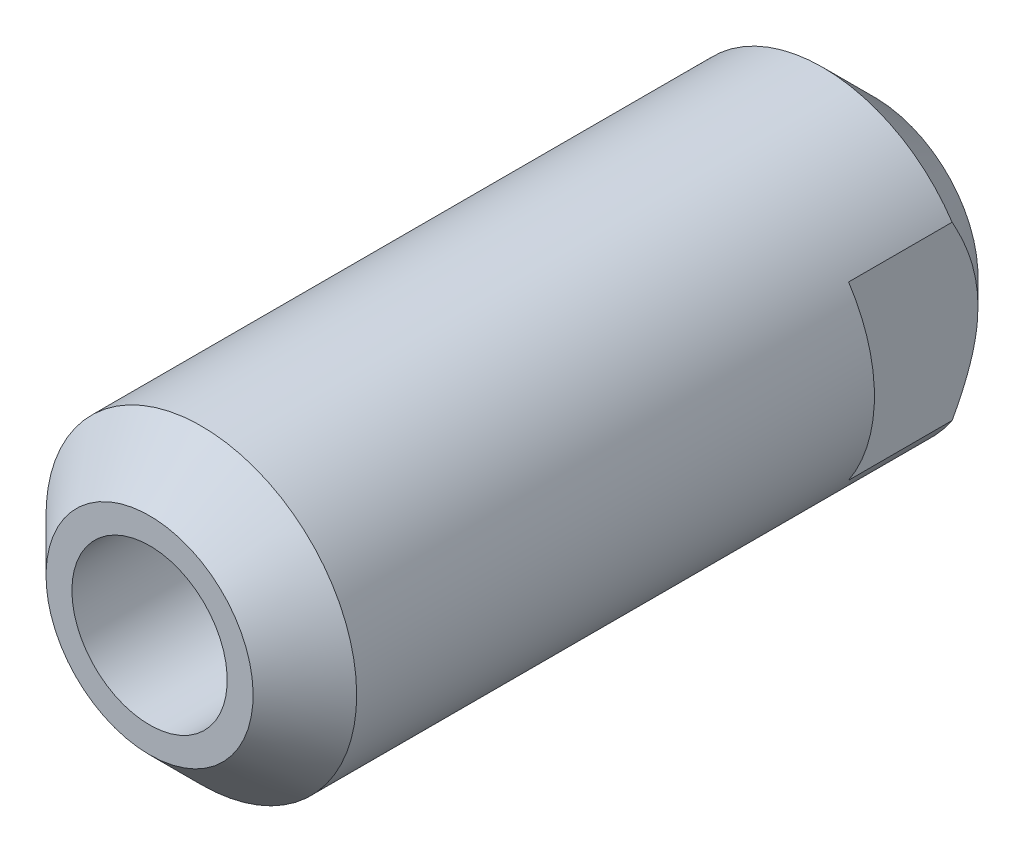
ISO-10303-21;
HEADER;
FILE_DESCRIPTION(('STEP AP214'),'2;1');
FILE_NAME('part.step','',(''),(''),'','','');
FILE_SCHEMA(('AUTOMOTIVE_DESIGN { 1 0 10303 214 1 1 1 1 }'));
ENDSEC;
DATA;
#1=APPLICATION_CONTEXT('core data for automotive mechanical design processes');
#2=APPLICATION_PROTOCOL_DEFINITION('international standard','automotive_design',2000,#1);
#3=PRODUCT_CONTEXT('',#1,'mechanical');
#4=PRODUCT('Part','Part','',(#3));
#5=PRODUCT_RELATED_PRODUCT_CATEGORY('part','',(#4));
#6=PRODUCT_DEFINITION_FORMATION('','',#4);
#7=PRODUCT_DEFINITION_CONTEXT('part definition',#1,'design');
#8=PRODUCT_DEFINITION('design','',#6,#7);
#9=PRODUCT_DEFINITION_SHAPE('','',#8);
#10=(LENGTH_UNIT() NAMED_UNIT(*) SI_UNIT(.MILLI.,.METRE.));
#11=(NAMED_UNIT(*) PLANE_ANGLE_UNIT() SI_UNIT($,.RADIAN.));
#12=(NAMED_UNIT(*) SI_UNIT($,.STERADIAN.) SOLID_ANGLE_UNIT());
#13=UNCERTAINTY_MEASURE_WITH_UNIT(LENGTH_MEASURE(1.E-05),#10,'distance_accuracy_value','');
#14=(GEOMETRIC_REPRESENTATION_CONTEXT(3) GLOBAL_UNCERTAINTY_ASSIGNED_CONTEXT((#13)) GLOBAL_UNIT_ASSIGNED_CONTEXT((#10,
#11,#12)) REPRESENTATION_CONTEXT('',''));
#15=CARTESIAN_POINT('',(0.,0.,0.));
#16=DIRECTION('',(0.,0.,1.));
#17=DIRECTION('',(1.,0.,0.));
#18=AXIS2_PLACEMENT_3D('',#15,#16,#17);
#19=CARTESIAN_POINT('',(-5.00000000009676,-3.35642428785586,6.));
#20=DIRECTION('',(0.,0.,1.));
#21=DIRECTION('',(2.88275454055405E-11,1.,0.));
#22=AXIS2_PLACEMENT_3D('',#19,#20,#21);
#23=PLANE('',#22);
#24=DIRECTION('',(-2.88275454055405E-11,-1.,0.));
#25=VECTOR('',#24,1.);
#26=CARTESIAN_POINT('',(-5.,1.44137727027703E-10,6.));
#27=LINE('',#26,#25);
#28=CARTESIAN_POINT('',(-4.99999999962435,3.31662479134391,6.000000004));
#29=VERTEX_POINT('',#28);
#30=CARTESIAN_POINT('',(-5.0000000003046,-3.31662478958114,6.000000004));
#31=VERTEX_POINT('',#30);
#32=EDGE_CURVE('E54',#29,#31,#27,.T.);
#33=ORIENTED_EDGE('',*,*,#32,.T.);
#34=CARTESIAN_POINT('',(0.,0.,6.000000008));
#35=DIRECTION('',(0.,0.,1.));
#36=DIRECTION('',(-1.,2.88275454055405E-11,0.));
#37=AXIS2_PLACEMENT_3D('',#34,#35,#36);
#38=CIRCLE('',#37,6.);
#39=EDGE_CURVE('E18',#29,#31,#38,.T.);
#40=ORIENTED_EDGE('',*,*,#39,.F.);
#41=EDGE_LOOP('',(#33,#40));
#42=FACE_BOUND('',#41,.T.);
#43=ADVANCED_FACE('F14',(#42),#23,.F.);
#44=CARTESIAN_POINT('',(6.04983453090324,-3.3564242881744,6.));
#45=DIRECTION('',(0.,0.,1.));
#46=DIRECTION('',(2.88275454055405E-11,1.,0.));
#47=AXIS2_PLACEMENT_3D('',#44,#45,#46);
#48=PLANE('',#47);
#49=DIRECTION('',(2.88275454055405E-11,1.,0.));
#50=VECTOR('',#49,1.);
#51=CARTESIAN_POINT('',(5.,-1.44137727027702E-10,6.));
#52=LINE('',#51,#50);
#53=CARTESIAN_POINT('',(4.99999999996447,-3.31662479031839,6.000000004));
#54=VERTEX_POINT('',#53);
#55=CARTESIAN_POINT('',(4.99999999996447,3.31662479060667,6.000000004));
#56=VERTEX_POINT('',#55);
#57=EDGE_CURVE('E71',#54,#56,#52,.T.);
#58=ORIENTED_EDGE('',*,*,#57,.T.);
#59=CARTESIAN_POINT('',(0.,0.,6.000000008));
#60=DIRECTION('',(0.,0.,1.));
#61=DIRECTION('',(-1.,2.88275454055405E-11,0.));
#62=AXIS2_PLACEMENT_3D('',#59,#60,#61);
#63=CIRCLE('',#62,6.);
#64=EDGE_CURVE('E147',#54,#56,#63,.T.);
#65=ORIENTED_EDGE('',*,*,#64,.F.);
#66=EDGE_LOOP('',(#58,#65));
#67=FACE_BOUND('',#66,.T.);
#68=ADVANCED_FACE('F138',(#67),#48,.F.);
#69=CARTESIAN_POINT('',(-4.99999999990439,3.31662479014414,0.942674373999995));
#70=DIRECTION('',(1.,-2.88275454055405E-11,0.));
#71=DIRECTION('',(0.,0.,1.));
#72=AXIS2_PLACEMENT_3D('',#69,#70,#71);
#73=PLANE('',#72);
#74=CARTESIAN_POINT('',(-5.00000000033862,-3.31662478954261,1.99999999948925));
#75=CARTESIAN_POINT('',(-5.00000000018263,-3.22769814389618,1.95084947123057));
#76=CARTESIAN_POINT('',(-5.00000000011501,-3.1381959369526,1.90274222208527));
#77=CARTESIAN_POINT('',(-5.00000000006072,-2.95792294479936,1.80890434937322));
#78=CARTESIAN_POINT('',(-5.00000000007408,-2.86715180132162,1.76317441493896));
#79=CARTESIAN_POINT('',(-5.00000000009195,-2.59213467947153,1.6296872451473));
#80=CARTESIAN_POINT('',(-5.00000000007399,-2.40586588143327,1.54601451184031));
#81=CARTESIAN_POINT('',(-5.00000000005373,-2.02581803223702,1.39198439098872));
#82=CARTESIAN_POINT('',(-5.00000000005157,-1.83198534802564,1.3217576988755));
#83=CARTESIAN_POINT('',(-5.00000000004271,-1.43883347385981,1.19956614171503));
#84=CARTESIAN_POINT('',(-5.00000000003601,-1.23952350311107,1.14757240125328));
#85=CARTESIAN_POINT('',(-5.00000000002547,-0.890804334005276,1.07668679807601));
#86=CARTESIAN_POINT('',(-5.00000000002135,-0.742441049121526,1.05264869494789));
#87=CARTESIAN_POINT('',(-5.00000000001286,-0.444151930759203,1.01750537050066));
#88=CARTESIAN_POINT('',(-5.0000000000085,-0.294226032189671,1.00640069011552));
#89=CARTESIAN_POINT('',(-4.99999999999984,0.00508217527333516,0.997778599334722));
#90=CARTESIAN_POINT('',(-4.99999999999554,0.154462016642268,1.00017661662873));
#91=CARTESIAN_POINT('',(-4.99999999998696,0.452409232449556,1.01822109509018));
#92=CARTESIAN_POINT('',(-4.99999999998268,0.600976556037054,1.03386837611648));
#93=CARTESIAN_POINT('',(-4.9999999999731,0.933262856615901,1.08307594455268));
#94=CARTESIAN_POINT('',(-4.99999999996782,1.11646272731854,1.12014207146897));
#95=CARTESIAN_POINT('',(-4.99999999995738,1.47863691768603,1.21109899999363));
#96=CARTESIAN_POINT('',(-4.99999999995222,1.65760895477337,1.26499867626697));
#97=CARTESIAN_POINT('',(-4.99999999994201,2.01163790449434,1.38692000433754));
#98=CARTESIAN_POINT('',(-4.99999999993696,2.18666980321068,1.45501320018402));
#99=CARTESIAN_POINT('',(-4.99999999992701,2.53188011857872,1.60232433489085));
#100=CARTESIAN_POINT('',(-4.99999999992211,2.70205985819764,1.68153920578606));
#101=CARTESIAN_POINT('',(-4.99999999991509,2.94549138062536,1.80272733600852));
#102=CARTESIAN_POINT('',(-4.99999999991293,3.02052062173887,1.84119139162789));
#103=CARTESIAN_POINT('',(-4.99999999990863,3.16936965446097,1.91953739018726));
#104=CARTESIAN_POINT('',(-4.99999999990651,3.24319355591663,1.95941151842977));
#105=CARTESIAN_POINT('',(-4.99999999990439,3.31662479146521,2.00000000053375));
#106=B_SPLINE_CURVE_WITH_KNOTS('',3,(#74,#75,#76,#77,#78,#79,#80,#81,#82,#83,#84,#85,#86,#87,
#88,#89,#90,#91,#92,#93,#94,#95,#96,#97,#98,#99,#100,#101,#102,#103,#104,#105),.UNSPECIFIED.,
.F.,.F.,(4,2,2,2,2,2,2,2,2,2,2,2,2,2,2,4),(0.,0.30480377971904,0.609695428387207,
1.22181743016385,1.83961676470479,2.45643322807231,2.9068223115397,3.3572302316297,
3.80482023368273,4.25243793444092,4.81220618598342,5.37227004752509,5.93522837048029,
6.49803170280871,6.75095972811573,7.00265636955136),.UNSPECIFIED.);
#107=CARTESIAN_POINT('',(-5.00000000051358,-3.31662478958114,2.));
#108=VERTEX_POINT('',#107);
#109=CARTESIAN_POINT('',(-4.9999999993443,3.31662479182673,2.00000000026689));
#110=VERTEX_POINT('',#109);
#111=EDGE_CURVE('E70',#108,#110,#106,.T.);
#112=ORIENTED_EDGE('',*,*,#111,.F.);
#113=DIRECTION('',(0.,0.,-1.));
#114=VECTOR('',#113,1.);
#115=CARTESIAN_POINT('',(-5.00000000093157,-3.31662478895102,14.));
#116=LINE('',#115,#114);
#117=EDGE_CURVE('E63',#31,#108,#116,.T.);
#118=ORIENTED_EDGE('',*,*,#117,.F.);
#119=ORIENTED_EDGE('',*,*,#32,.F.);
#120=DIRECTION('',(0.,0.,1.));
#121=VECTOR('',#120,1.);
#122=CARTESIAN_POINT('',(-4.99999999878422,3.31662479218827,14.));
#123=LINE('',#122,#121);
#124=EDGE_CURVE('E65',#110,#29,#123,.T.);
#125=ORIENTED_EDGE('',*,*,#124,.F.);
#126=EDGE_LOOP('',(#112,#118,#119,#125));
#127=FACE_BOUND('',#126,.T.);
#128=ADVANCED_FACE('F68',(#127),#73,.F.);
#129=CARTESIAN_POINT('',(5.00000000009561,3.31662478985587,6.));
#130=DIRECTION('',(-1.,2.88275454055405E-11,0.));
#131=DIRECTION('',(0.,0.,-1.));
#132=AXIS2_PLACEMENT_3D('',#129,#130,#131);
#133=PLANE('',#132);
#134=CARTESIAN_POINT('',(5.00000000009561,3.31662479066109,2.00000000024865));
#135=CARTESIAN_POINT('',(5.00000000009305,3.22769814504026,1.95084947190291));
#136=CARTESIAN_POINT('',(5.00000000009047,3.13819593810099,1.90274222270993));
#137=CARTESIAN_POINT('',(5.00000000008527,2.95792294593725,1.80890434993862));
#138=CARTESIAN_POINT('',(5.00000000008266,2.8671518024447,1.76317441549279));
#139=CARTESIAN_POINT('',(5.00000000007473,2.5921346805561,1.62968724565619));
#140=CARTESIAN_POINT('',(5.00000000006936,2.40586588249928,1.54601451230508));
#141=CARTESIAN_POINT('',(5.0000000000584,2.02581803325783,1.39198439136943));
#142=CARTESIAN_POINT('',(5.00000000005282,1.83198534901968,1.32175769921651));
#143=CARTESIAN_POINT('',(5.00000000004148,1.4388334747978,1.19956614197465));
#144=CARTESIAN_POINT('',(5.00000000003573,1.23952350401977,1.14757240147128));
#145=CARTESIAN_POINT('',(5.00000000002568,0.890804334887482,1.07668679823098));
#146=CARTESIAN_POINT('',(5.0000000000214,0.742441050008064,1.05264869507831));
#147=CARTESIAN_POINT('',(5.00000000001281,0.444151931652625,1.01750537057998));
#148=CARTESIAN_POINT('',(5.00000000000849,0.294226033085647,1.00640069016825));
#149=CARTESIAN_POINT('',(4.99999999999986,-0.00508217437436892,0.997778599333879));
#150=CARTESIAN_POINT('',(4.99999999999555,-0.154462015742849,1.00017661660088));
#151=CARTESIAN_POINT('',(4.99999999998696,-0.45240923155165,1.01822109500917));
#152=CARTESIAN_POINT('',(4.99999999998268,-0.600976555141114,1.03386837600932));
#153=CARTESIAN_POINT('',(4.9999999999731,-0.933262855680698,1.08307594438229));
#154=CARTESIAN_POINT('',(4.99999999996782,-1.11646272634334,1.12014207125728));
#155=CARTESIAN_POINT('',(4.99999999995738,-1.47863691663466,1.21109899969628));
#156=CARTESIAN_POINT('',(4.99999999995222,-1.65760895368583,1.26499867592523));
#157=CARTESIAN_POINT('',(4.99999999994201,-2.01163790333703,1.38692000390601));
#158=CARTESIAN_POINT('',(4.99999999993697,-2.1866698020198,1.45501319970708));
#159=CARTESIAN_POINT('',(4.99999999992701,-2.53188011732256,1.60232433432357));
#160=CARTESIAN_POINT('',(4.9999999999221,-2.70205985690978,1.68153920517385));
#161=CARTESIAN_POINT('',(4.99999999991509,-2.94549137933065,1.802727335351));
#162=CARTESIAN_POINT('',(4.99999999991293,-3.02052062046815,1.84119139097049));
#163=CARTESIAN_POINT('',(4.99999999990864,-3.16936965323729,1.91953738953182));
#164=CARTESIAN_POINT('',(4.99999999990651,-3.24319355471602,1.95941151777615));
#165=CARTESIAN_POINT('',(4.99999999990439,-3.31662479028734,1.9999999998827));
#166=B_SPLINE_CURVE_WITH_KNOTS('',3,(#134,#135,#136,#137,#138,#139,#140,#141,#142,#143,#144,
#145,#146,#147,#148,#149,#150,#151,#152,#153,#154,#155,#156,#157,#158,#159,#160,#161,#162,#163,
#164,#165),.UNSPECIFIED.,.F.,.F.,(4,2,2,2,2,2,2,2,2,2,2,2,2,2,2,4),(0.,0.304803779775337,
0.609695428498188,1.22181743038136,1.83961676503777,2.4564332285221,2.90682231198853,
3.35723023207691,3.80482023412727,4.25243793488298,4.81220618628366,5.37227004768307,
5.93522837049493,6.49803170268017,6.75095972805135,7.00265636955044),.UNSPECIFIED.);
#167=CARTESIAN_POINT('',(4.99999999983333,3.31662479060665,2.));
#168=VERTEX_POINT('',#167);
#169=CARTESIAN_POINT('',(5.00000000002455,-3.3166247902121,1.99999999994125));
#170=VERTEX_POINT('',#169);
#171=EDGE_CURVE('E33',#168,#170,#166,.T.);
#172=ORIENTED_EDGE('',*,*,#171,.F.);
#173=DIRECTION('',(0.,0.,-1.));
#174=VECTOR('',#173,1.);
#175=CARTESIAN_POINT('',(4.99999999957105,3.31662479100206,14.));
#176=LINE('',#175,#174);
#177=EDGE_CURVE('E81',#56,#168,#176,.T.);
#178=ORIENTED_EDGE('',*,*,#177,.F.);
#179=ORIENTED_EDGE('',*,*,#57,.F.);
#180=DIRECTION('',(0.,0.,1.));
#181=VECTOR('',#180,1.);
#182=CARTESIAN_POINT('',(5.00000000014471,-3.31662479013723,14.));
#183=LINE('',#182,#181);
#184=EDGE_CURVE('E74',#170,#54,#183,.T.);
#185=ORIENTED_EDGE('',*,*,#184,.F.);
#186=EDGE_LOOP('',(#172,#178,#179,#185));
#187=FACE_BOUND('',#186,.T.);
#188=ADVANCED_FACE('F109',(#187),#133,.F.);
#189=CARTESIAN_POINT('',(0.,0.,2.));
#190=DIRECTION('',(0.,0.,1.));
#191=DIRECTION('',(-1.,2.88275454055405E-11,0.));
#192=AXIS2_PLACEMENT_3D('',#189,#190,#191);
#193=CYLINDRICAL_SURFACE('',#192,6.);
#194=ORIENTED_EDGE('',*,*,#117,.T.);
#195=CARTESIAN_POINT('',(0.,0.,2.));
#196=DIRECTION('',(0.,0.,1.));
#197=DIRECTION('',(2.88275454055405E-11,1.,0.));
#198=AXIS2_PLACEMENT_3D('',#195,#196,#197);
#199=CIRCLE('',#198,6.);
#200=EDGE_CURVE('E91',#170,#108,#199,.F.);
#201=ORIENTED_EDGE('',*,*,#200,.F.);
#202=ORIENTED_EDGE('',*,*,#184,.T.);
#203=ORIENTED_EDGE('',*,*,#64,.T.);
#204=ORIENTED_EDGE('',*,*,#177,.T.);
#205=CARTESIAN_POINT('',(0.,0.,2.));
#206=DIRECTION('',(0.,0.,1.));
#207=DIRECTION('',(2.88275454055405E-11,1.,0.));
#208=AXIS2_PLACEMENT_3D('',#205,#206,#207);
#209=CIRCLE('',#208,6.);
#210=EDGE_CURVE('E99',#110,#168,#209,.F.);
#211=ORIENTED_EDGE('',*,*,#210,.F.);
#212=ORIENTED_EDGE('',*,*,#124,.T.);
#213=ORIENTED_EDGE('',*,*,#39,.T.);
#214=EDGE_LOOP('',(#194,#201,#202,#203,#204,#211,#212,#213));
#215=FACE_BOUND('',#214,.T.);
#216=CARTESIAN_POINT('',(0.,0.,26.));
#217=DIRECTION('',(0.,0.,-1.));
#218=DIRECTION('',(-2.88275454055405E-11,-1.,0.));
#219=AXIS2_PLACEMENT_3D('',#216,#217,#218);
#220=CIRCLE('',#219,6.);
#221=CARTESIAN_POINT('',(-1.72980306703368E-10,-6.,26.));
#222=VERTEX_POINT('',#221);
#223=EDGE_CURVE('E79',#222,#222,#220,.F.);
#224=ORIENTED_EDGE('',*,*,#223,.F.);
#225=EDGE_LOOP('',(#224));
#226=FACE_BOUND('',#225,.T.);
#227=ADVANCED_FACE('F60',(#215,#226),#193,.T.);
#228=CARTESIAN_POINT('',(0.,0.,28.));
#229=DIRECTION('',(0.,0.,-1.));
#230=DIRECTION('',(-2.88275454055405E-11,-1.,0.));
#231=AXIS2_PLACEMENT_3D('',#228,#229,#230);
#232=CONICAL_SURFACE('',#231,4.,0.785398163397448);
#233=ORIENTED_EDGE('',*,*,#223,.T.);
#234=EDGE_LOOP('',(#233));
#235=FACE_BOUND('',#234,.T.);
#236=CARTESIAN_POINT('',(0.,0.,28.));
#237=DIRECTION('',(0.,0.,-1.));
#238=DIRECTION('',(-2.88275454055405E-11,-1.,0.));
#239=AXIS2_PLACEMENT_3D('',#236,#237,#238);
#240=CIRCLE('',#239,4.);
#241=CARTESIAN_POINT('',(-1.15326372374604E-10,-4.,28.));
#242=VERTEX_POINT('',#241);
#243=EDGE_CURVE('E88',#242,#242,#240,.F.);
#244=ORIENTED_EDGE('',*,*,#243,.F.);
#245=EDGE_LOOP('',(#244));
#246=FACE_BOUND('',#245,.T.);
#247=ADVANCED_FACE('F126',(#235,#246),#232,.T.);
#248=CARTESIAN_POINT('',(0.,0.,0.));
#249=DIRECTION('',(0.,0.,1.));
#250=DIRECTION('',(-1.,2.88275454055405E-11,0.));
#251=AXIS2_PLACEMENT_3D('',#248,#249,#250);
#252=CONICAL_SURFACE('',#251,4.,0.785398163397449);
#253=CARTESIAN_POINT('',(0.,0.,0.));
#254=DIRECTION('',(0.,0.,1.));
#255=DIRECTION('',(-1.,2.88275454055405E-11,0.));
#256=AXIS2_PLACEMENT_3D('',#253,#254,#255);
#257=CIRCLE('',#256,4.);
#258=CARTESIAN_POINT('',(-4.,1.15310181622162E-10,0.));
#259=VERTEX_POINT('',#258);
#260=EDGE_CURVE('E85',#259,#259,#257,.F.);
#261=ORIENTED_EDGE('',*,*,#260,.F.);
#262=EDGE_LOOP('',(#261));
#263=FACE_BOUND('',#262,.T.);
#264=ORIENTED_EDGE('',*,*,#171,.T.);
#265=ORIENTED_EDGE('',*,*,#200,.T.);
#266=ORIENTED_EDGE('',*,*,#111,.T.);
#267=ORIENTED_EDGE('',*,*,#210,.T.);
#268=EDGE_LOOP('',(#264,#265,#266,#267));
#269=FACE_BOUND('',#268,.T.);
#270=ADVANCED_FACE('F105',(#263,#269),#252,.T.);
#271=CARTESIAN_POINT('',(4.06192904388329,-4.04800000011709,28.));
#272=DIRECTION('',(0.,0.,1.));
#273=DIRECTION('',(2.88275454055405E-11,1.,0.));
#274=AXIS2_PLACEMENT_3D('',#271,#272,#273);
#275=PLANE('',#274);
#276=CARTESIAN_POINT('',(0.,0.,28.));
#277=DIRECTION('',(0.,0.,1.));
#278=DIRECTION('',(-1.,2.88275454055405E-11,0.));
#279=AXIS2_PLACEMENT_3D('',#276,#277,#278);
#280=CIRCLE('',#279,3.);
#281=CARTESIAN_POINT('',(-3.,8.64826362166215E-11,28.));
#282=VERTEX_POINT('',#281);
#283=EDGE_CURVE('E24',#282,#282,#280,.F.);
#284=ORIENTED_EDGE('',*,*,#283,.T.);
#285=EDGE_LOOP('',(#284));
#286=FACE_BOUND('',#285,.T.);
#287=ORIENTED_EDGE('',*,*,#243,.T.);
#288=EDGE_LOOP('',(#287));
#289=FACE_BOUND('',#288,.T.);
#290=ADVANCED_FACE('F115',(#286,#289),#275,.T.);
#291=CARTESIAN_POINT('',(4.0619290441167,4.04799999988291,0.));
#292=DIRECTION('',(0.,0.,-1.));
#293=DIRECTION('',(-2.88275454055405E-11,-1.,0.));
#294=AXIS2_PLACEMENT_3D('',#291,#292,#293);
#295=PLANE('',#294);
#296=CARTESIAN_POINT('',(0.,0.,0.));
#297=DIRECTION('',(0.,0.,1.));
#298=DIRECTION('',(-1.,2.88275454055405E-11,0.));
#299=AXIS2_PLACEMENT_3D('',#296,#297,#298);
#300=CIRCLE('',#299,3.);
#301=CARTESIAN_POINT('',(-3.,8.64826362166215E-11,0.));
#302=VERTEX_POINT('',#301);
#303=EDGE_CURVE('E9',#302,#302,#300,.T.);
#304=ORIENTED_EDGE('',*,*,#303,.T.);
#305=EDGE_LOOP('',(#304));
#306=FACE_BOUND('',#305,.T.);
#307=ORIENTED_EDGE('',*,*,#260,.T.);
#308=EDGE_LOOP('',(#307));
#309=FACE_BOUND('',#308,.T.);
#310=ADVANCED_FACE('F16',(#306,#309),#295,.T.);
#311=CARTESIAN_POINT('',(0.,0.,0.));
#312=DIRECTION('',(0.,0.,1.));
#313=DIRECTION('',(-1.,2.88275454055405E-11,0.));
#314=AXIS2_PLACEMENT_3D('',#311,#312,#313);
#315=CYLINDRICAL_SURFACE('',#314,3.);
#316=ORIENTED_EDGE('',*,*,#283,.F.);
#317=EDGE_LOOP('',(#316));
#318=FACE_BOUND('',#317,.T.);
#319=ORIENTED_EDGE('',*,*,#303,.F.);
#320=EDGE_LOOP('',(#319));
#321=FACE_BOUND('',#320,.T.);
#322=ADVANCED_FACE('F124',(#318,#321),#315,.F.);
#323=CLOSED_SHELL('',(#43,#68,#128,#188,#227,#247,#270,#290,#310,#322));
#324=MANIFOLD_SOLID_BREP('B1',#323);
#325=ADVANCED_BREP_SHAPE_REPRESENTATION('',(#18,#324),#14);
#326=SHAPE_DEFINITION_REPRESENTATION(#9,#325);
ENDSEC;
END-ISO-10303-21;
